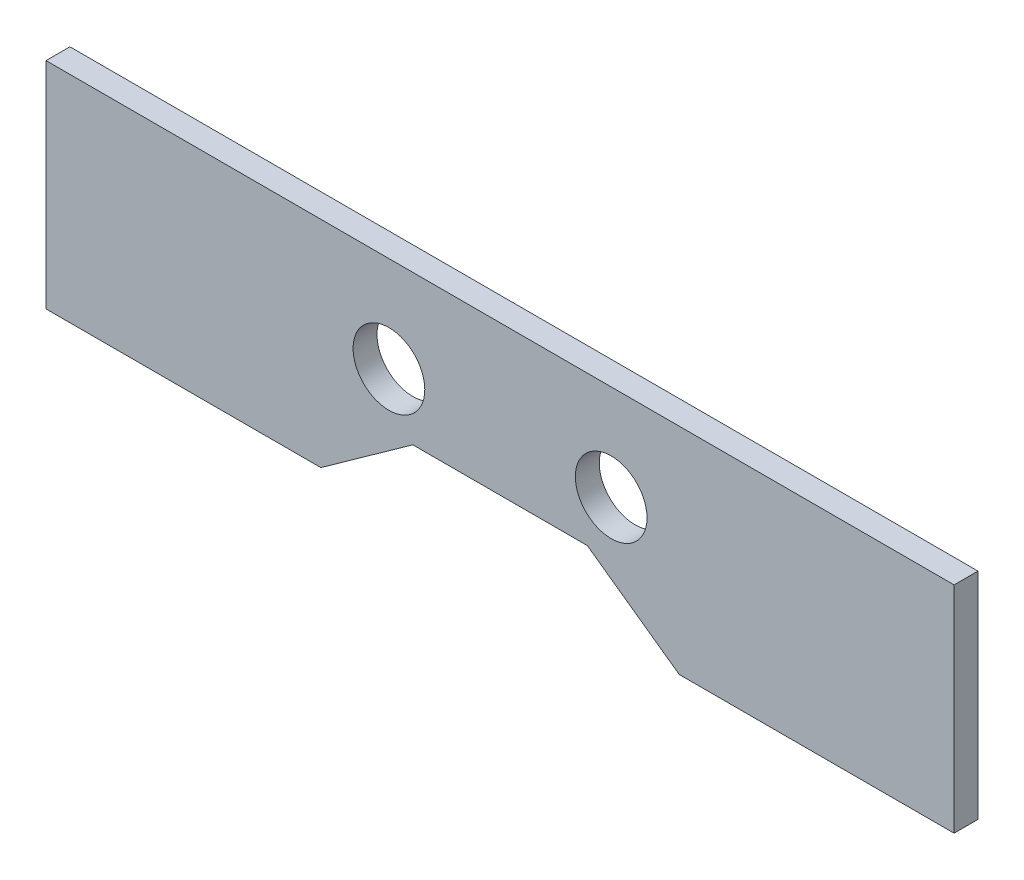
ISO-10303-21;
HEADER;
FILE_DESCRIPTION(('STEP AP214'),'2;1');
FILE_NAME('part.step','',(''),(''),'','','');
FILE_SCHEMA(('AUTOMOTIVE_DESIGN { 1 0 10303 214 1 1 1 1 }'));
ENDSEC;
DATA;
#1=APPLICATION_CONTEXT('core data for automotive mechanical design processes');
#2=APPLICATION_PROTOCOL_DEFINITION('international standard','automotive_design',2000,#1);
#3=PRODUCT_CONTEXT('',#1,'mechanical');
#4=PRODUCT('Part','Part','',(#3));
#5=PRODUCT_RELATED_PRODUCT_CATEGORY('part','',(#4));
#6=PRODUCT_DEFINITION_FORMATION('','',#4);
#7=PRODUCT_DEFINITION_CONTEXT('part definition',#1,'design');
#8=PRODUCT_DEFINITION('design','',#6,#7);
#9=PRODUCT_DEFINITION_SHAPE('','',#8);
#10=(LENGTH_UNIT() NAMED_UNIT(*) SI_UNIT(.MILLI.,.METRE.));
#11=(NAMED_UNIT(*) PLANE_ANGLE_UNIT() SI_UNIT($,.RADIAN.));
#12=(NAMED_UNIT(*) SI_UNIT($,.STERADIAN.) SOLID_ANGLE_UNIT());
#13=UNCERTAINTY_MEASURE_WITH_UNIT(LENGTH_MEASURE(1.E-05),#10,'distance_accuracy_value','');
#14=(GEOMETRIC_REPRESENTATION_CONTEXT(3) GLOBAL_UNCERTAINTY_ASSIGNED_CONTEXT((#13)) GLOBAL_UNIT_ASSIGNED_CONTEXT((#10,
#11,#12)) REPRESENTATION_CONTEXT('',''));
#15=CARTESIAN_POINT('',(0.,0.,0.));
#16=DIRECTION('',(0.,0.,1.));
#17=DIRECTION('',(1.,0.,0.));
#18=AXIS2_PLACEMENT_3D('',#15,#16,#17);
#19=CARTESIAN_POINT('',(-482.6,-121.1326,25.4));
#20=DIRECTION('',(0.,1.,0.));
#21=DIRECTION('',(-1.,0.,0.));
#22=AXIS2_PLACEMENT_3D('',#19,#20,#21);
#23=PLANE('',#22);
#24=DIRECTION('',(1.,0.,0.));
#25=VECTOR('',#24,1.);
#26=CARTESIAN_POINT('',(-482.6,-121.1326,0.));
#27=LINE('',#26,#25);
#28=CARTESIAN_POINT('',(-482.6,-121.1326,0.));
#29=VERTEX_POINT('',#28);
#30=CARTESIAN_POINT('',(-190.5,-121.1326,0.));
#31=VERTEX_POINT('',#30);
#32=EDGE_CURVE('E184',#29,#31,#27,.T.);
#33=ORIENTED_EDGE('',*,*,#32,.T.);
#34=DIRECTION('',(0.,0.,1.));
#35=VECTOR('',#34,1.);
#36=CARTESIAN_POINT('',(-190.5,-121.1326,0.));
#37=LINE('',#36,#35);
#38=CARTESIAN_POINT('',(-190.5,-121.1326,25.4));
#39=VERTEX_POINT('',#38);
#40=EDGE_CURVE('E153',#31,#39,#37,.T.);
#41=ORIENTED_EDGE('',*,*,#40,.T.);
#42=DIRECTION('',(1.,0.,0.));
#43=VECTOR('',#42,1.);
#44=CARTESIAN_POINT('',(-482.6,-121.1326,25.4));
#45=LINE('',#44,#43);
#46=CARTESIAN_POINT('',(-482.6,-121.1326,25.4));
#47=VERTEX_POINT('',#46);
#48=EDGE_CURVE('E195',#47,#39,#45,.T.);
#49=ORIENTED_EDGE('',*,*,#48,.F.);
#50=DIRECTION('',(0.,0.,-1.));
#51=VECTOR('',#50,1.);
#52=CARTESIAN_POINT('',(-482.6,-121.1326,25.4));
#53=LINE('',#52,#51);
#54=EDGE_CURVE('E202',#47,#29,#53,.T.);
#55=ORIENTED_EDGE('',*,*,#54,.T.);
#56=EDGE_LOOP('',(#33,#41,#49,#55));
#57=FACE_BOUND('',#56,.T.);
#58=ADVANCED_FACE('F41',(#57),#23,.F.);
#59=CARTESIAN_POINT('',(482.6,107.4674,25.4));
#60=DIRECTION('',(0.,0.,1.));
#61=DIRECTION('',(1.,0.,0.));
#62=AXIS2_PLACEMENT_3D('',#59,#60,#61);
#63=PLANE('',#62);
#64=DIRECTION('',(-0.813733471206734,-0.581238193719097,0.));
#65=VECTOR('',#64,1.);
#66=CARTESIAN_POINT('',(-190.5,-121.1326,25.4));
#67=LINE('',#66,#65);
#68=CARTESIAN_POINT('',(-92.71,-51.2825999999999,25.4));
#69=VERTEX_POINT('',#68);
#70=EDGE_CURVE('E140',#69,#39,#67,.T.);
#71=ORIENTED_EDGE('',*,*,#70,.F.);
#72=DIRECTION('',(-1.,0.,0.));
#73=VECTOR('',#72,1.);
#74=CARTESIAN_POINT('',(-92.71,-51.2825999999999,25.4));
#75=LINE('',#74,#73);
#76=CARTESIAN_POINT('',(92.71,-51.2825999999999,25.4));
#77=VERTEX_POINT('',#76);
#78=EDGE_CURVE('E144',#77,#69,#75,.T.);
#79=ORIENTED_EDGE('',*,*,#78,.F.);
#80=DIRECTION('',(-0.813733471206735,0.581238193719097,0.));
#81=VECTOR('',#80,1.);
#82=CARTESIAN_POINT('',(92.71,-51.2825999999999,25.4));
#83=LINE('',#82,#81);
#84=CARTESIAN_POINT('',(190.5,-121.1326,25.4));
#85=VERTEX_POINT('',#84);
#86=EDGE_CURVE('E117',#85,#77,#83,.T.);
#87=ORIENTED_EDGE('',*,*,#86,.F.);
#88=CARTESIAN_POINT('',(482.6,-121.1326,25.4));
#89=VERTEX_POINT('',#88);
#90=EDGE_CURVE('E67',#85,#89,#45,.T.);
#91=ORIENTED_EDGE('',*,*,#90,.T.);
#92=DIRECTION('',(0.,1.,0.));
#93=VECTOR('',#92,1.);
#94=CARTESIAN_POINT('',(482.6,107.4674,25.4));
#95=LINE('',#94,#93);
#96=CARTESIAN_POINT('',(482.6,107.4674,25.4));
#97=VERTEX_POINT('',#96);
#98=EDGE_CURVE('E188',#89,#97,#95,.T.);
#99=ORIENTED_EDGE('',*,*,#98,.T.);
#100=DIRECTION('',(-1.,0.,0.));
#101=VECTOR('',#100,1.);
#102=CARTESIAN_POINT('',(-482.6,107.4674,25.4));
#103=LINE('',#102,#101);
#104=CARTESIAN_POINT('',(-482.6,107.4674,25.4));
#105=VERTEX_POINT('',#104);
#106=EDGE_CURVE('E190',#97,#105,#103,.T.);
#107=ORIENTED_EDGE('',*,*,#106,.T.);
#108=DIRECTION('',(0.,-1.,0.));
#109=VECTOR('',#108,1.);
#110=CARTESIAN_POINT('',(-482.6,107.4674,25.4));
#111=LINE('',#110,#109);
#112=EDGE_CURVE('E193',#105,#47,#111,.T.);
#113=ORIENTED_EDGE('',*,*,#112,.T.);
#114=ORIENTED_EDGE('',*,*,#48,.T.);
#115=EDGE_LOOP('',(#71,#79,#87,#91,#99,#107,#113,#114));
#116=FACE_BOUND('',#115,.T.);
#117=CARTESIAN_POINT('',(118.11,5.86740000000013,25.4));
#118=DIRECTION('',(0.,0.,1.));
#119=DIRECTION('',(1.,0.,0.));
#120=AXIS2_PLACEMENT_3D('',#117,#118,#119);
#121=CIRCLE('',#120,38.1);
#122=CARTESIAN_POINT('',(156.21,5.86740000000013,25.4));
#123=VERTEX_POINT('',#122);
#124=EDGE_CURVE('E172',#123,#123,#121,.T.);
#125=ORIENTED_EDGE('',*,*,#124,.F.);
#126=EDGE_LOOP('',(#125));
#127=FACE_BOUND('',#126,.T.);
#128=CARTESIAN_POINT('',(-118.11,5.86740000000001,25.4));
#129=DIRECTION('',(0.,0.,1.));
#130=DIRECTION('',(1.,0.,0.));
#131=AXIS2_PLACEMENT_3D('',#128,#129,#130);
#132=CIRCLE('',#131,38.1);
#133=CARTESIAN_POINT('',(-80.01,5.86740000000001,25.4));
#134=VERTEX_POINT('',#133);
#135=EDGE_CURVE('E164',#134,#134,#132,.T.);
#136=ORIENTED_EDGE('',*,*,#135,.F.);
#137=EDGE_LOOP('',(#136));
#138=FACE_BOUND('',#137,.T.);
#139=ADVANCED_FACE('F216',(#116,#127,#138),#63,.T.);
#140=CARTESIAN_POINT('',(482.6,107.4674,0.));
#141=DIRECTION('',(0.,0.,1.));
#142=DIRECTION('',(1.,0.,0.));
#143=AXIS2_PLACEMENT_3D('',#140,#141,#142);
#144=PLANE('',#143);
#145=CARTESIAN_POINT('',(118.11,5.86740000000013,0.));
#146=DIRECTION('',(0.,0.,1.));
#147=DIRECTION('',(1.,0.,0.));
#148=AXIS2_PLACEMENT_3D('',#145,#146,#147);
#149=CIRCLE('',#148,38.1);
#150=CARTESIAN_POINT('',(156.21,5.86740000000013,0.));
#151=VERTEX_POINT('',#150);
#152=EDGE_CURVE('E168',#151,#151,#149,.T.);
#153=ORIENTED_EDGE('',*,*,#152,.T.);
#154=EDGE_LOOP('',(#153));
#155=FACE_BOUND('',#154,.T.);
#156=DIRECTION('',(-1.,0.,0.));
#157=VECTOR('',#156,1.);
#158=CARTESIAN_POINT('',(-92.71,-51.2825999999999,0.));
#159=LINE('',#158,#157);
#160=CARTESIAN_POINT('',(92.71,-51.2825999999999,0.));
#161=VERTEX_POINT('',#160);
#162=CARTESIAN_POINT('',(-92.71,-51.2825999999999,0.));
#163=VERTEX_POINT('',#162);
#164=EDGE_CURVE('E126',#161,#163,#159,.T.);
#165=ORIENTED_EDGE('',*,*,#164,.T.);
#166=DIRECTION('',(-0.813733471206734,-0.581238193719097,0.));
#167=VECTOR('',#166,1.);
#168=CARTESIAN_POINT('',(-190.5,-121.1326,0.));
#169=LINE('',#168,#167);
#170=EDGE_CURVE('E132',#163,#31,#169,.T.);
#171=ORIENTED_EDGE('',*,*,#170,.T.);
#172=ORIENTED_EDGE('',*,*,#32,.F.);
#173=DIRECTION('',(0.,-1.,0.));
#174=VECTOR('',#173,1.);
#175=CARTESIAN_POINT('',(-482.6,107.4674,0.));
#176=LINE('',#175,#174);
#177=CARTESIAN_POINT('',(-482.6,107.4674,0.));
#178=VERTEX_POINT('',#177);
#179=EDGE_CURVE('E182',#178,#29,#176,.T.);
#180=ORIENTED_EDGE('',*,*,#179,.F.);
#181=DIRECTION('',(-1.,0.,0.));
#182=VECTOR('',#181,1.);
#183=CARTESIAN_POINT('',(-482.6,107.4674,0.));
#184=LINE('',#183,#182);
#185=CARTESIAN_POINT('',(482.6,107.4674,0.));
#186=VERTEX_POINT('',#185);
#187=EDGE_CURVE('E179',#186,#178,#184,.T.);
#188=ORIENTED_EDGE('',*,*,#187,.F.);
#189=DIRECTION('',(0.,1.,0.));
#190=VECTOR('',#189,1.);
#191=CARTESIAN_POINT('',(482.6,107.4674,0.));
#192=LINE('',#191,#190);
#193=CARTESIAN_POINT('',(482.6,-121.1326,0.));
#194=VERTEX_POINT('',#193);
#195=EDGE_CURVE('E176',#194,#186,#192,.T.);
#196=ORIENTED_EDGE('',*,*,#195,.F.);
#197=CARTESIAN_POINT('',(190.5,-121.1326,0.));
#198=VERTEX_POINT('',#197);
#199=EDGE_CURVE('E138',#198,#194,#27,.T.);
#200=ORIENTED_EDGE('',*,*,#199,.F.);
#201=DIRECTION('',(-0.813733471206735,0.581238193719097,0.));
#202=VECTOR('',#201,1.);
#203=CARTESIAN_POINT('',(92.71,-51.2825999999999,0.));
#204=LINE('',#203,#202);
#205=EDGE_CURVE('E59',#198,#161,#204,.T.);
#206=ORIENTED_EDGE('',*,*,#205,.T.);
#207=EDGE_LOOP('',(#165,#171,#172,#180,#188,#196,#200,#206));
#208=FACE_BOUND('',#207,.T.);
#209=CARTESIAN_POINT('',(-118.11,5.86740000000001,0.));
#210=DIRECTION('',(0.,0.,1.));
#211=DIRECTION('',(1.,0.,0.));
#212=AXIS2_PLACEMENT_3D('',#209,#210,#211);
#213=CIRCLE('',#212,38.1);
#214=CARTESIAN_POINT('',(-80.01,5.86740000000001,0.));
#215=VERTEX_POINT('',#214);
#216=EDGE_CURVE('E157',#215,#215,#213,.T.);
#217=ORIENTED_EDGE('',*,*,#216,.T.);
#218=EDGE_LOOP('',(#217));
#219=FACE_BOUND('',#218,.T.);
#220=ADVANCED_FACE('F135',(#155,#208,#219),#144,.F.);
#221=CARTESIAN_POINT('',(482.6,107.4674,25.4));
#222=DIRECTION('',(-1.,0.,0.));
#223=DIRECTION('',(0.,0.,1.));
#224=AXIS2_PLACEMENT_3D('',#221,#222,#223);
#225=PLANE('',#224);
#226=ORIENTED_EDGE('',*,*,#195,.T.);
#227=DIRECTION('',(0.,0.,-1.));
#228=VECTOR('',#227,1.);
#229=CARTESIAN_POINT('',(482.6,107.4674,25.4));
#230=LINE('',#229,#228);
#231=EDGE_CURVE('E11',#97,#186,#230,.T.);
#232=ORIENTED_EDGE('',*,*,#231,.F.);
#233=ORIENTED_EDGE('',*,*,#98,.F.);
#234=DIRECTION('',(0.,0.,-1.));
#235=VECTOR('',#234,1.);
#236=CARTESIAN_POINT('',(482.6,-121.1326,25.4));
#237=LINE('',#236,#235);
#238=EDGE_CURVE('E199',#89,#194,#237,.T.);
#239=ORIENTED_EDGE('',*,*,#238,.T.);
#240=EDGE_LOOP('',(#226,#232,#233,#239));
#241=FACE_BOUND('',#240,.T.);
#242=ADVANCED_FACE('F43',(#241),#225,.F.);
#243=CARTESIAN_POINT('',(-482.6,107.4674,25.4));
#244=DIRECTION('',(0.,-1.,0.));
#245=DIRECTION('',(1.,0.,0.));
#246=AXIS2_PLACEMENT_3D('',#243,#244,#245);
#247=PLANE('',#246);
#248=ORIENTED_EDGE('',*,*,#187,.T.);
#249=DIRECTION('',(0.,0.,-1.));
#250=VECTOR('',#249,1.);
#251=CARTESIAN_POINT('',(-482.6,107.4674,25.4));
#252=LINE('',#251,#250);
#253=EDGE_CURVE('E49',#105,#178,#252,.T.);
#254=ORIENTED_EDGE('',*,*,#253,.F.);
#255=ORIENTED_EDGE('',*,*,#106,.F.);
#256=ORIENTED_EDGE('',*,*,#231,.T.);
#257=EDGE_LOOP('',(#248,#254,#255,#256));
#258=FACE_BOUND('',#257,.T.);
#259=ADVANCED_FACE('F220',(#258),#247,.F.);
#260=CARTESIAN_POINT('',(-482.6,107.4674,25.4));
#261=DIRECTION('',(1.,0.,0.));
#262=DIRECTION('',(0.,0.,-1.));
#263=AXIS2_PLACEMENT_3D('',#260,#261,#262);
#264=PLANE('',#263);
#265=ORIENTED_EDGE('',*,*,#179,.T.);
#266=ORIENTED_EDGE('',*,*,#54,.F.);
#267=ORIENTED_EDGE('',*,*,#112,.F.);
#268=ORIENTED_EDGE('',*,*,#253,.T.);
#269=EDGE_LOOP('',(#265,#266,#267,#268));
#270=FACE_BOUND('',#269,.T.);
#271=ADVANCED_FACE('F209',(#270),#264,.F.);
#272=ORIENTED_EDGE('',*,*,#90,.F.);
#273=DIRECTION('',(0.,0.,1.));
#274=VECTOR('',#273,1.);
#275=CARTESIAN_POINT('',(190.5,-121.1326,0.));
#276=LINE('',#275,#274);
#277=EDGE_CURVE('E123',#198,#85,#276,.T.);
#278=ORIENTED_EDGE('',*,*,#277,.F.);
#279=ORIENTED_EDGE('',*,*,#199,.T.);
#280=ORIENTED_EDGE('',*,*,#238,.F.);
#281=EDGE_LOOP('',(#272,#278,#279,#280));
#282=FACE_BOUND('',#281,.T.);
#283=ADVANCED_FACE('F223',(#282),#23,.F.);
#284=CARTESIAN_POINT('',(118.11,5.86740000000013,25.4));
#285=DIRECTION('',(0.,0.,-1.));
#286=DIRECTION('',(-1.,0.,0.));
#287=AXIS2_PLACEMENT_3D('',#284,#285,#286);
#288=CYLINDRICAL_SURFACE('',#287,38.1);
#289=ORIENTED_EDGE('',*,*,#124,.T.);
#290=EDGE_LOOP('',(#289));
#291=FACE_BOUND('',#290,.T.);
#292=ORIENTED_EDGE('',*,*,#152,.F.);
#293=EDGE_LOOP('',(#292));
#294=FACE_BOUND('',#293,.T.);
#295=ADVANCED_FACE('F227',(#291,#294),#288,.F.);
#296=CARTESIAN_POINT('',(-118.11,5.86740000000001,25.4));
#297=DIRECTION('',(0.,0.,-1.));
#298=DIRECTION('',(-1.,0.,0.));
#299=AXIS2_PLACEMENT_3D('',#296,#297,#298);
#300=CYLINDRICAL_SURFACE('',#299,38.1);
#301=ORIENTED_EDGE('',*,*,#135,.T.);
#302=EDGE_LOOP('',(#301));
#303=FACE_BOUND('',#302,.T.);
#304=ORIENTED_EDGE('',*,*,#216,.F.);
#305=EDGE_LOOP('',(#304));
#306=FACE_BOUND('',#305,.T.);
#307=ADVANCED_FACE('F233',(#303,#306),#300,.F.);
#308=CARTESIAN_POINT('',(-190.5,-121.1326,0.));
#309=DIRECTION('',(-0.581238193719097,0.813733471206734,0.));
#310=DIRECTION('',(-0.813733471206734,-0.581238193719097,0.));
#311=AXIS2_PLACEMENT_3D('',#308,#309,#310);
#312=PLANE('',#311);
#313=ORIENTED_EDGE('',*,*,#70,.T.);
#314=ORIENTED_EDGE('',*,*,#40,.F.);
#315=ORIENTED_EDGE('',*,*,#170,.F.);
#316=DIRECTION('',(0.,0.,1.));
#317=VECTOR('',#316,1.);
#318=CARTESIAN_POINT('',(-92.71,-51.2825999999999,0.));
#319=LINE('',#318,#317);
#320=EDGE_CURVE('E122',#163,#69,#319,.T.);
#321=ORIENTED_EDGE('',*,*,#320,.T.);
#322=EDGE_LOOP('',(#313,#314,#315,#321));
#323=FACE_BOUND('',#322,.T.);
#324=ADVANCED_FACE('F250',(#323),#312,.F.);
#325=CARTESIAN_POINT('',(-92.71,-51.2825999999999,0.));
#326=DIRECTION('',(0.,1.,0.));
#327=DIRECTION('',(0.,0.,1.));
#328=AXIS2_PLACEMENT_3D('',#325,#326,#327);
#329=PLANE('',#328);
#330=ORIENTED_EDGE('',*,*,#78,.T.);
#331=ORIENTED_EDGE('',*,*,#320,.F.);
#332=ORIENTED_EDGE('',*,*,#164,.F.);
#333=DIRECTION('',(0.,0.,1.));
#334=VECTOR('',#333,1.);
#335=CARTESIAN_POINT('',(92.71,-51.2825999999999,0.));
#336=LINE('',#335,#334);
#337=EDGE_CURVE('E114',#161,#77,#336,.T.);
#338=ORIENTED_EDGE('',*,*,#337,.T.);
#339=EDGE_LOOP('',(#330,#331,#332,#338));
#340=FACE_BOUND('',#339,.T.);
#341=ADVANCED_FACE('F127',(#340),#329,.F.);
#342=CARTESIAN_POINT('',(92.71,-51.2825999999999,0.));
#343=DIRECTION('',(0.581238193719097,0.813733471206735,0.));
#344=DIRECTION('',(-0.813733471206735,0.581238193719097,0.));
#345=AXIS2_PLACEMENT_3D('',#342,#343,#344);
#346=PLANE('',#345);
#347=ORIENTED_EDGE('',*,*,#86,.T.);
#348=ORIENTED_EDGE('',*,*,#337,.F.);
#349=ORIENTED_EDGE('',*,*,#205,.F.);
#350=ORIENTED_EDGE('',*,*,#277,.T.);
#351=EDGE_LOOP('',(#347,#348,#349,#350));
#352=FACE_BOUND('',#351,.T.);
#353=ADVANCED_FACE('F116',(#352),#346,.F.);
#354=CLOSED_SHELL('',(#58,#139,#220,#242,#259,#271,#283,#295,#307,#324,#341,#353));
#355=MANIFOLD_SOLID_BREP('B2',#354);
#356=ADVANCED_BREP_SHAPE_REPRESENTATION('',(#18,#355),#14);
#357=SHAPE_DEFINITION_REPRESENTATION(#9,#356);
ENDSEC;
END-ISO-10303-21;
